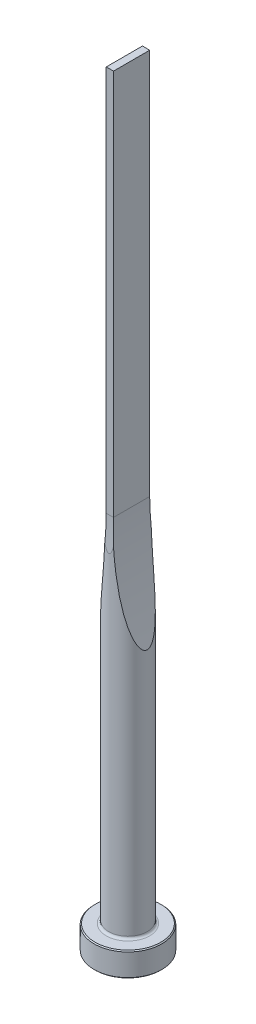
from build123d import *

# Parameters (mm, degrees)
CUT_EXTRUDE1_DEPTH = 5
CUT_EXTRUDE2_DEPTH = 5


with BuildPart() as part:
    # Sketch1 → Revolve1 (revolve)
    with BuildSketch(Plane.XY, mode=Mode.PRIVATE) as revolve1_sk:
        with BuildLine():
            Line((0, 0), (6.8, 0))
            Line((6.8, 0), (7, 0.2))
            Line((7, 0.2), (7, 4.8))
            Line((7, 4.8), (6.8, 5))
            Line((6.8, 5), (4.5, 5))
            ThreePointArc((4.5, 5), (4.146446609, 5.146446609), (4, 5.5))
            Line((4, 5.5), (4, 160))
            Line((4, 160), (0, 160))
            Line((0, 160), (0, 0))
        make_face()
    revolve(revolve1_sk.sketch.rotate(Axis((0, 160, 0), (0, -1, 0)), 180), axis=Axis((0, 160, 0), (0, -1, 0)))

    # Sketch2 → Cut-Extrude1 (cut, symmetric)
    with BuildSketch(Plane.XY):
        with BuildLine():
            Line((0.75, 160), (0.75, 80))
            ThreePointArc((0.75, 80), (1.566201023, 67.906613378), (4, 56.032574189))
            Line((4, 56.032574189), (4, 160))
            Line((4, 160), (0.75, 160))
        make_face()
        with BuildLine():
            Line((-0.75, 160), (-0.75, 80))
            ThreePointArc((-0.75, 80), (-1.566201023, 67.906613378), (-4, 56.032574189))
            Line((-4, 56.032574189), (-4, 160))
            Line((-4, 160), (-0.75, 160))
        make_face()
    extrude(amount=CUT_EXTRUDE1_DEPTH, both=True, mode=Mode.SUBTRACT)

    # Sketch3 → Cut-Extrude2 (cut, symmetric)
    with BuildSketch(Plane(origin=(0, 0, 0), x_dir=(0, 0, -1), z_dir=(1, 0, 0))):
        with BuildLine():
            Line((3.75, 160), (3.75, 80))
            ThreePointArc((3.75, 80), (3.812521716, 76.645898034), (4, 73.296456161))
            Line((4, 73.296456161), (4, 160))
            Line((4, 160), (3.75, 160))
        make_face()
        with BuildLine():
            Line((-3.75, 160), (-3.75, 80))
            ThreePointArc((-3.75, 80), (-3.812521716, 76.645898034), (-4, 73.296456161))
            Line((-4, 73.296456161), (-4, 160))
            Line((-4, 160), (-3.75, 160))
        make_face()
    extrude(amount=CUT_EXTRUDE2_DEPTH, both=True, mode=Mode.SUBTRACT)


solid = part.part
